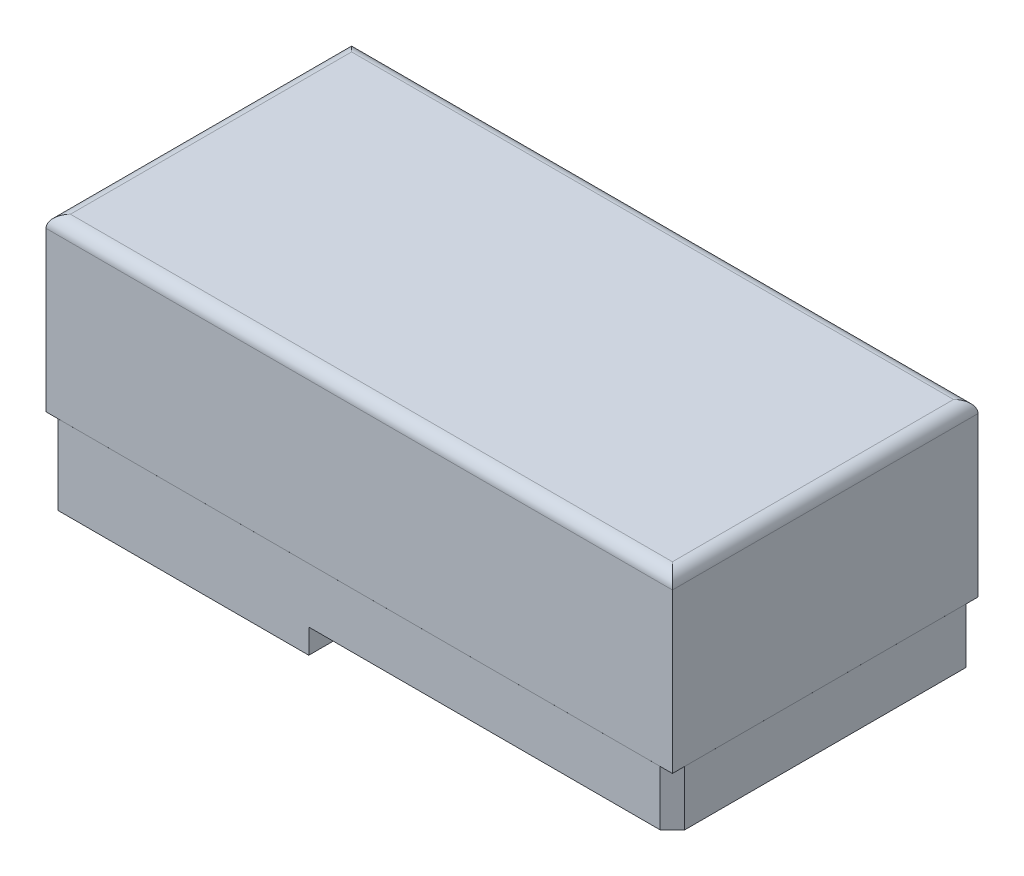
ISO-10303-21;
HEADER;
FILE_DESCRIPTION(('STEP AP214'),'2;1');
FILE_NAME('part.step','',(''),(''),'','','');
FILE_SCHEMA(('AUTOMOTIVE_DESIGN { 1 0 10303 214 1 1 1 1 }'));
ENDSEC;
DATA;
#1=APPLICATION_CONTEXT('core data for automotive mechanical design processes');
#2=APPLICATION_PROTOCOL_DEFINITION('international standard','automotive_design',2000,#1);
#3=PRODUCT_CONTEXT('',#1,'mechanical');
#4=PRODUCT('Part','Part','',(#3));
#5=PRODUCT_RELATED_PRODUCT_CATEGORY('part','',(#4));
#6=PRODUCT_DEFINITION_FORMATION('','',#4);
#7=PRODUCT_DEFINITION_CONTEXT('part definition',#1,'design');
#8=PRODUCT_DEFINITION('design','',#6,#7);
#9=PRODUCT_DEFINITION_SHAPE('','',#8);
#10=(LENGTH_UNIT() NAMED_UNIT(*) SI_UNIT(.MILLI.,.METRE.));
#11=(NAMED_UNIT(*) PLANE_ANGLE_UNIT() SI_UNIT($,.RADIAN.));
#12=(NAMED_UNIT(*) SI_UNIT($,.STERADIAN.) SOLID_ANGLE_UNIT());
#13=UNCERTAINTY_MEASURE_WITH_UNIT(LENGTH_MEASURE(1.E-05),#10,'distance_accuracy_value','');
#14=(GEOMETRIC_REPRESENTATION_CONTEXT(3) GLOBAL_UNCERTAINTY_ASSIGNED_CONTEXT((#13)) GLOBAL_UNIT_ASSIGNED_CONTEXT((#10,
#11,#12)) REPRESENTATION_CONTEXT('',''));
#15=CARTESIAN_POINT('',(0.,0.,0.));
#16=DIRECTION('',(0.,0.,1.));
#17=DIRECTION('',(1.,0.,0.));
#18=AXIS2_PLACEMENT_3D('',#15,#16,#17);
#19=CARTESIAN_POINT('',(-46.0331698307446,-4.,25.));
#20=DIRECTION('',(0.,1.,0.));
#21=DIRECTION('',(-1.,0.,0.));
#22=AXIS2_PLACEMENT_3D('',#19,#20,#21);
#23=PLANE('',#22);
#24=CARTESIAN_POINT('',(-68.0331698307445,-4.00000000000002,0.));
#25=DIRECTION('',(0.,1.,0.));
#26=DIRECTION('',(0.,0.,1.));
#27=AXIS2_PLACEMENT_3D('',#24,#25,#26);
#28=CIRCLE('',#27,7.99999999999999);
#29=CARTESIAN_POINT('',(-68.0331698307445,-4.00000000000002,7.99999999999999));
#30=VERTEX_POINT('',#29);
#31=EDGE_CURVE('E255',#30,#30,#28,.T.);
#32=ORIENTED_EDGE('',*,*,#31,.T.);
#33=EDGE_LOOP('',(#32));
#34=FACE_BOUND('',#33,.T.);
#35=DIRECTION('',(0.,0.,-1.));
#36=VECTOR('',#35,1.);
#37=CARTESIAN_POINT('',(-89.0331698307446,-4.00000000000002,25.));
#38=LINE('',#37,#36);
#39=CARTESIAN_POINT('',(-89.0331698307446,-4.00000000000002,23.));
#40=VERTEX_POINT('',#39);
#41=CARTESIAN_POINT('',(-89.0331698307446,-4.00000000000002,-23.));
#42=VERTEX_POINT('',#41);
#43=EDGE_CURVE('E261',#40,#42,#38,.T.);
#44=ORIENTED_EDGE('',*,*,#43,.T.);
#45=DIRECTION('',(0.70710678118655,0.,-0.707106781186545));
#46=VECTOR('',#45,1.);
#47=CARTESIAN_POINT('',(-89.0331698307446,-4.00000000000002,-23.));
#48=LINE('',#47,#46);
#49=CARTESIAN_POINT('',(-87.0331698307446,-4.00000000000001,-25.));
#50=VERTEX_POINT('',#49);
#51=EDGE_CURVE('E215',#42,#50,#48,.T.);
#52=ORIENTED_EDGE('',*,*,#51,.T.);
#53=DIRECTION('',(1.,0.,0.));
#54=VECTOR('',#53,1.);
#55=CARTESIAN_POINT('',(-46.0331698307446,-4.,-25.));
#56=LINE('',#55,#54);
#57=CARTESIAN_POINT('',(-46.0331698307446,-4.,-25.));
#58=VERTEX_POINT('',#57);
#59=EDGE_CURVE('E257',#50,#58,#56,.T.);
#60=ORIENTED_EDGE('',*,*,#59,.T.);
#61=DIRECTION('',(0.,0.,-1.));
#62=VECTOR('',#61,1.);
#63=CARTESIAN_POINT('',(-46.0331698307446,-4.,25.));
#64=LINE('',#63,#62);
#65=CARTESIAN_POINT('',(-46.0331698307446,-4.,25.));
#66=VERTEX_POINT('',#65);
#67=EDGE_CURVE('E249',#66,#58,#64,.T.);
#68=ORIENTED_EDGE('',*,*,#67,.F.);
#69=DIRECTION('',(1.,0.,0.));
#70=VECTOR('',#69,1.);
#71=CARTESIAN_POINT('',(-46.0331698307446,-4.,25.));
#72=LINE('',#71,#70);
#73=CARTESIAN_POINT('',(-87.0331698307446,-4.00000000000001,25.));
#74=VERTEX_POINT('',#73);
#75=EDGE_CURVE('E199',#74,#66,#72,.T.);
#76=ORIENTED_EDGE('',*,*,#75,.F.);
#77=DIRECTION('',(0.707106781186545,0.,0.70710678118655));
#78=VECTOR('',#77,1.);
#79=CARTESIAN_POINT('',(-87.0331698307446,-4.00000000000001,25.));
#80=LINE('',#79,#78);
#81=EDGE_CURVE('E213',#74,#40,#80,.F.);
#82=ORIENTED_EDGE('',*,*,#81,.T.);
#83=EDGE_LOOP('',(#44,#52,#60,#68,#76,#82));
#84=FACE_BOUND('',#83,.T.);
#85=ADVANCED_FACE('F44',(#34,#84),#23,.F.);
#86=CARTESIAN_POINT('',(-46.0331698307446,0.,25.));
#87=DIRECTION('',(-1.,0.,0.));
#88=DIRECTION('',(0.,0.,1.));
#89=AXIS2_PLACEMENT_3D('',#86,#87,#88);
#90=PLANE('',#89);
#91=DIRECTION('',(0.,1.,0.));
#92=VECTOR('',#91,1.);
#93=CARTESIAN_POINT('',(-46.0331698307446,0.,-25.));
#94=LINE('',#93,#92);
#95=CARTESIAN_POINT('',(-46.0331698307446,0.,-25.));
#96=VERTEX_POINT('',#95);
#97=EDGE_CURVE('E258',#58,#96,#94,.T.);
#98=ORIENTED_EDGE('',*,*,#97,.T.);
#99=DIRECTION('',(0.,0.,-1.));
#100=VECTOR('',#99,1.);
#101=CARTESIAN_POINT('',(-46.0331698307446,0.,25.));
#102=LINE('',#101,#100);
#103=CARTESIAN_POINT('',(-46.0331698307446,0.,25.));
#104=VERTEX_POINT('',#103);
#105=EDGE_CURVE('E205',#104,#96,#102,.T.);
#106=ORIENTED_EDGE('',*,*,#105,.F.);
#107=DIRECTION('',(0.,1.,0.));
#108=VECTOR('',#107,1.);
#109=CARTESIAN_POINT('',(-46.0331698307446,0.,25.));
#110=LINE('',#109,#108);
#111=EDGE_CURVE('E250',#66,#104,#110,.T.);
#112=ORIENTED_EDGE('',*,*,#111,.F.);
#113=ORIENTED_EDGE('',*,*,#67,.T.);
#114=EDGE_LOOP('',(#98,#106,#112,#113));
#115=FACE_BOUND('',#114,.T.);
#116=ADVANCED_FACE('F305',(#115),#90,.F.);
#117=CARTESIAN_POINT('',(13.4668301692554,0.,25.));
#118=DIRECTION('',(0.,1.,0.));
#119=DIRECTION('',(-1.,0.,0.));
#120=AXIS2_PLACEMENT_3D('',#117,#118,#119);
#121=PLANE('',#120);
#122=DIRECTION('',(-1.,0.,0.));
#123=VECTOR('',#122,1.);
#124=CARTESIAN_POINT('',(13.4668301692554,0.,-5.));
#125=LINE('',#124,#123);
#126=CARTESIAN_POINT('',(-4.53316983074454,0.,-5.));
#127=VERTEX_POINT('',#126);
#128=CARTESIAN_POINT('',(-14.5331698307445,0.,-5.));
#129=VERTEX_POINT('',#128);
#130=EDGE_CURVE('E174',#127,#129,#125,.T.);
#131=ORIENTED_EDGE('',*,*,#130,.T.);
#132=CARTESIAN_POINT('',(-14.5331698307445,0.,0.));
#133=DIRECTION('',(0.,1.,0.));
#134=DIRECTION('',(-1.,0.,0.));
#135=AXIS2_PLACEMENT_3D('',#132,#133,#134);
#136=CIRCLE('',#135,5.);
#137=CARTESIAN_POINT('',(-14.5331698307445,0.,5.));
#138=VERTEX_POINT('',#137);
#139=EDGE_CURVE('E172',#129,#138,#136,.T.);
#140=ORIENTED_EDGE('',*,*,#139,.T.);
#141=DIRECTION('',(1.,0.,0.));
#142=VECTOR('',#141,1.);
#143=CARTESIAN_POINT('',(13.4668301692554,0.,5.));
#144=LINE('',#143,#142);
#145=CARTESIAN_POINT('',(-4.53316983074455,0.,5.));
#146=VERTEX_POINT('',#145);
#147=EDGE_CURVE('E152',#138,#146,#144,.T.);
#148=ORIENTED_EDGE('',*,*,#147,.T.);
#149=CARTESIAN_POINT('',(-4.53316983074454,0.,0.));
#150=DIRECTION('',(0.,1.,0.));
#151=DIRECTION('',(-1.,0.,0.));
#152=AXIS2_PLACEMENT_3D('',#149,#150,#151);
#153=CIRCLE('',#152,5.);
#154=EDGE_CURVE('E162',#146,#127,#153,.T.);
#155=ORIENTED_EDGE('',*,*,#154,.T.);
#156=EDGE_LOOP('',(#131,#140,#148,#155));
#157=FACE_BOUND('',#156,.T.);
#158=DIRECTION('',(1.,0.,0.));
#159=VECTOR('',#158,1.);
#160=CARTESIAN_POINT('',(13.4668301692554,0.,-25.));
#161=LINE('',#160,#159);
#162=CARTESIAN_POINT('',(11.4668301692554,0.,-25.));
#163=VERTEX_POINT('',#162);
#164=EDGE_CURVE('E168',#96,#163,#161,.T.);
#165=ORIENTED_EDGE('',*,*,#164,.T.);
#166=DIRECTION('',(0.70710678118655,0.,0.707106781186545));
#167=VECTOR('',#166,1.);
#168=CARTESIAN_POINT('',(13.4668301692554,0.,-23.));
#169=LINE('',#168,#167);
#170=CARTESIAN_POINT('',(13.4668301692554,0.,-23.));
#171=VERTEX_POINT('',#170);
#172=EDGE_CURVE('E65',#163,#171,#169,.T.);
#173=ORIENTED_EDGE('',*,*,#172,.T.);
#174=DIRECTION('',(0.,0.,-1.));
#175=VECTOR('',#174,1.);
#176=CARTESIAN_POINT('',(13.4668301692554,0.,25.));
#177=LINE('',#176,#175);
#178=CARTESIAN_POINT('',(13.4668301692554,0.,23.));
#179=VERTEX_POINT('',#178);
#180=EDGE_CURVE('E204',#179,#171,#177,.T.);
#181=ORIENTED_EDGE('',*,*,#180,.F.);
#182=DIRECTION('',(0.707106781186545,0.,-0.70710678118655));
#183=VECTOR('',#182,1.);
#184=CARTESIAN_POINT('',(11.4668301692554,0.,25.));
#185=LINE('',#184,#183);
#186=CARTESIAN_POINT('',(11.4668301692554,0.,25.));
#187=VERTEX_POINT('',#186);
#188=EDGE_CURVE('E59',#179,#187,#185,.F.);
#189=ORIENTED_EDGE('',*,*,#188,.T.);
#190=DIRECTION('',(1.,0.,0.));
#191=VECTOR('',#190,1.);
#192=CARTESIAN_POINT('',(13.4668301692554,0.,25.));
#193=LINE('',#192,#191);
#194=EDGE_CURVE('E185',#104,#187,#193,.T.);
#195=ORIENTED_EDGE('',*,*,#194,.F.);
#196=ORIENTED_EDGE('',*,*,#105,.T.);
#197=EDGE_LOOP('',(#165,#173,#181,#189,#195,#196));
#198=FACE_BOUND('',#197,.T.);
#199=ADVANCED_FACE('F171',(#157,#198),#121,.F.);
#200=CARTESIAN_POINT('',(13.4668301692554,8.00000000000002,25.));
#201=DIRECTION('',(-1.,0.,0.));
#202=DIRECTION('',(0.,-1.,0.));
#203=AXIS2_PLACEMENT_3D('',#200,#201,#202);
#204=PLANE('',#203);
#205=ORIENTED_EDGE('',*,*,#180,.T.);
#206=DIRECTION('',(0.,1.,0.));
#207=VECTOR('',#206,1.);
#208=CARTESIAN_POINT('',(13.4668301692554,9.,-23.));
#209=LINE('',#208,#207);
#210=CARTESIAN_POINT('',(13.4668301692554,8.99999999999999,-23.));
#211=VERTEX_POINT('',#210);
#212=EDGE_CURVE('E231',#171,#211,#209,.T.);
#213=ORIENTED_EDGE('',*,*,#212,.T.);
#214=DIRECTION('',(0.,0.,1.));
#215=VECTOR('',#214,1.);
#216=CARTESIAN_POINT('',(13.4668301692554,8.99999999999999,25.));
#217=LINE('',#216,#215);
#218=CARTESIAN_POINT('',(13.4668301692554,8.99999999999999,23.));
#219=VERTEX_POINT('',#218);
#220=EDGE_CURVE('E201',#211,#219,#217,.T.);
#221=ORIENTED_EDGE('',*,*,#220,.T.);
#222=DIRECTION('',(0.,-1.,0.));
#223=VECTOR('',#222,1.);
#224=CARTESIAN_POINT('',(13.4668301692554,8.00000000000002,23.));
#225=LINE('',#224,#223);
#226=EDGE_CURVE('E229',#219,#179,#225,.T.);
#227=ORIENTED_EDGE('',*,*,#226,.T.);
#228=EDGE_LOOP('',(#205,#213,#221,#227));
#229=FACE_BOUND('',#228,.T.);
#230=ADVANCED_FACE('F280',(#229),#204,.F.);
#231=CARTESIAN_POINT('',(-89.0331698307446,-4.00000000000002,25.));
#232=DIRECTION('',(1.,0.,0.));
#233=DIRECTION('',(0.,0.,-1.));
#234=AXIS2_PLACEMENT_3D('',#231,#232,#233);
#235=PLANE('',#234);
#236=DIRECTION('',(0.,0.,-1.));
#237=VECTOR('',#236,1.);
#238=CARTESIAN_POINT('',(-89.0331698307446,9.,25.));
#239=LINE('',#238,#237);
#240=CARTESIAN_POINT('',(-89.0331698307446,9.,23.));
#241=VERTEX_POINT('',#240);
#242=CARTESIAN_POINT('',(-89.0331698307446,9.,-23.));
#243=VERTEX_POINT('',#242);
#244=EDGE_CURVE('E200',#241,#243,#239,.T.);
#245=ORIENTED_EDGE('',*,*,#244,.T.);
#246=DIRECTION('',(0.,-1.,0.));
#247=VECTOR('',#246,1.);
#248=CARTESIAN_POINT('',(-89.0331698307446,-4.00000000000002,-23.));
#249=LINE('',#248,#247);
#250=EDGE_CURVE('E210',#243,#42,#249,.T.);
#251=ORIENTED_EDGE('',*,*,#250,.T.);
#252=ORIENTED_EDGE('',*,*,#43,.F.);
#253=DIRECTION('',(0.,1.,0.));
#254=VECTOR('',#253,1.);
#255=CARTESIAN_POINT('',(-89.0331698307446,-4.00000000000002,23.));
#256=LINE('',#255,#254);
#257=EDGE_CURVE('E208',#40,#241,#256,.T.);
#258=ORIENTED_EDGE('',*,*,#257,.T.);
#259=EDGE_LOOP('',(#245,#251,#252,#258));
#260=FACE_BOUND('',#259,.T.);
#261=ADVANCED_FACE('F298',(#260),#235,.F.);
#262=CARTESIAN_POINT('',(0.,0.,25.));
#263=DIRECTION('',(0.,0.,-1.));
#264=DIRECTION('',(-1.,0.,0.));
#265=AXIS2_PLACEMENT_3D('',#262,#263,#264);
#266=PLANE('',#265);
#267=ORIENTED_EDGE('',*,*,#194,.T.);
#268=DIRECTION('',(0.,1.,0.));
#269=VECTOR('',#268,1.);
#270=CARTESIAN_POINT('',(11.4668301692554,0.,25.));
#271=LINE('',#270,#269);
#272=CARTESIAN_POINT('',(11.4668301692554,8.99999999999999,25.));
#273=VERTEX_POINT('',#272);
#274=EDGE_CURVE('E12',#187,#273,#271,.T.);
#275=ORIENTED_EDGE('',*,*,#274,.T.);
#276=DIRECTION('',(-1.,0.,0.));
#277=VECTOR('',#276,1.);
#278=CARTESIAN_POINT('',(0.,8.99999999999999,25.));
#279=LINE('',#278,#277);
#280=CARTESIAN_POINT('',(-87.0331698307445,9.,25.));
#281=VERTEX_POINT('',#280);
#282=EDGE_CURVE('E196',#273,#281,#279,.T.);
#283=ORIENTED_EDGE('',*,*,#282,.T.);
#284=DIRECTION('',(0.,-1.,0.));
#285=VECTOR('',#284,1.);
#286=CARTESIAN_POINT('',(-87.0331698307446,0.,25.));
#287=LINE('',#286,#285);
#288=EDGE_CURVE('E52',#281,#74,#287,.T.);
#289=ORIENTED_EDGE('',*,*,#288,.T.);
#290=ORIENTED_EDGE('',*,*,#75,.T.);
#291=ORIENTED_EDGE('',*,*,#111,.T.);
#292=EDGE_LOOP('',(#267,#275,#283,#289,#290,#291));
#293=FACE_BOUND('',#292,.T.);
#294=ADVANCED_FACE('F239',(#293),#266,.F.);
#295=CARTESIAN_POINT('',(0.,0.,-25.));
#296=DIRECTION('',(0.,0.,-1.));
#297=DIRECTION('',(-1.,0.,0.));
#298=AXIS2_PLACEMENT_3D('',#295,#296,#297);
#299=PLANE('',#298);
#300=ORIENTED_EDGE('',*,*,#59,.F.);
#301=DIRECTION('',(0.,1.,0.));
#302=VECTOR('',#301,1.);
#303=CARTESIAN_POINT('',(-87.0331698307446,9.,-25.));
#304=LINE('',#303,#302);
#305=CARTESIAN_POINT('',(-87.0331698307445,9.,-25.));
#306=VERTEX_POINT('',#305);
#307=EDGE_CURVE('E219',#50,#306,#304,.T.);
#308=ORIENTED_EDGE('',*,*,#307,.T.);
#309=DIRECTION('',(-1.,0.,0.));
#310=VECTOR('',#309,1.);
#311=CARTESIAN_POINT('',(0.,8.99999999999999,-25.));
#312=LINE('',#311,#310);
#313=CARTESIAN_POINT('',(11.4668301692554,8.99999999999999,-25.));
#314=VERTEX_POINT('',#313);
#315=EDGE_CURVE('E195',#314,#306,#312,.T.);
#316=ORIENTED_EDGE('',*,*,#315,.F.);
#317=DIRECTION('',(0.,-1.,0.));
#318=VECTOR('',#317,1.);
#319=CARTESIAN_POINT('',(11.4668301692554,0.,-25.));
#320=LINE('',#319,#318);
#321=EDGE_CURVE('E217',#314,#163,#320,.T.);
#322=ORIENTED_EDGE('',*,*,#321,.T.);
#323=ORIENTED_EDGE('',*,*,#164,.F.);
#324=ORIENTED_EDGE('',*,*,#97,.F.);
#325=EDGE_LOOP('',(#300,#308,#316,#322,#323,#324));
#326=FACE_BOUND('',#325,.T.);
#327=ADVANCED_FACE('F289',(#326),#299,.T.);
#328=CARTESIAN_POINT('',(-68.0331698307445,-4.00000000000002,0.));
#329=DIRECTION('',(0.,1.,0.));
#330=DIRECTION('',(0.,0.,1.));
#331=AXIS2_PLACEMENT_3D('',#328,#329,#330);
#332=CYLINDRICAL_SURFACE('',#331,7.99999999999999);
#333=ORIENTED_EDGE('',*,*,#31,.F.);
#334=EDGE_LOOP('',(#333));
#335=FACE_BOUND('',#334,.T.);
#336=CARTESIAN_POINT('',(-68.0331698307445,8.,0.));
#337=DIRECTION('',(0.,1.,0.));
#338=DIRECTION('',(-1.,0.,0.));
#339=AXIS2_PLACEMENT_3D('',#336,#337,#338);
#340=CIRCLE('',#339,7.99999999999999);
#341=CARTESIAN_POINT('',(-76.0331698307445,8.,0.));
#342=VERTEX_POINT('',#341);
#343=EDGE_CURVE('E190',#342,#342,#340,.F.);
#344=ORIENTED_EDGE('',*,*,#343,.F.);
#345=EDGE_LOOP('',(#344));
#346=FACE_BOUND('',#345,.T.);
#347=ADVANCED_FACE('F315',(#335,#346),#332,.F.);
#348=CARTESIAN_POINT('',(-14.5331698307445,-4.00000000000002,0.));
#349=DIRECTION('',(0.,1.,0.));
#350=DIRECTION('',(0.,0.,1.));
#351=AXIS2_PLACEMENT_3D('',#348,#349,#350);
#352=CYLINDRICAL_SURFACE('',#351,5.);
#353=DIRECTION('',(0.,1.,0.));
#354=VECTOR('',#353,1.);
#355=CARTESIAN_POINT('',(-14.5331698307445,-4.00000000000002,-5.));
#356=LINE('',#355,#354);
#357=CARTESIAN_POINT('',(-14.5331698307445,8.00000000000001,-5.));
#358=VERTEX_POINT('',#357);
#359=EDGE_CURVE('E182',#129,#358,#356,.T.);
#360=ORIENTED_EDGE('',*,*,#359,.T.);
#361=CARTESIAN_POINT('',(-14.5331698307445,8.00000000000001,0.));
#362=DIRECTION('',(0.,1.,0.));
#363=DIRECTION('',(0.,0.,1.));
#364=AXIS2_PLACEMENT_3D('',#361,#362,#363);
#365=CIRCLE('',#364,5.);
#366=CARTESIAN_POINT('',(-14.5331698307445,8.00000000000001,5.));
#367=VERTEX_POINT('',#366);
#368=EDGE_CURVE('E181',#358,#367,#365,.T.);
#369=ORIENTED_EDGE('',*,*,#368,.T.);
#370=DIRECTION('',(0.,1.,0.));
#371=VECTOR('',#370,1.);
#372=CARTESIAN_POINT('',(-14.5331698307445,-4.00000000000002,5.));
#373=LINE('',#372,#371);
#374=EDGE_CURVE('E178',#138,#367,#373,.T.);
#375=ORIENTED_EDGE('',*,*,#374,.F.);
#376=ORIENTED_EDGE('',*,*,#139,.F.);
#377=EDGE_LOOP('',(#360,#369,#375,#376));
#378=FACE_BOUND('',#377,.T.);
#379=ADVANCED_FACE('F318',(#378),#352,.F.);
#380=CARTESIAN_POINT('',(-14.5331698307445,-4.00000000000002,-5.));
#381=DIRECTION('',(0.,0.,-1.));
#382=DIRECTION('',(-1.,0.,0.));
#383=AXIS2_PLACEMENT_3D('',#380,#381,#382);
#384=PLANE('',#383);
#385=DIRECTION('',(0.,1.,0.));
#386=VECTOR('',#385,1.);
#387=CARTESIAN_POINT('',(-4.53316983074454,-4.00000000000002,-5.));
#388=LINE('',#387,#386);
#389=CARTESIAN_POINT('',(-4.53316983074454,8.00000000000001,-5.));
#390=VERTEX_POINT('',#389);
#391=EDGE_CURVE('E165',#127,#390,#388,.T.);
#392=ORIENTED_EDGE('',*,*,#391,.T.);
#393=DIRECTION('',(-1.,0.,0.));
#394=VECTOR('',#393,1.);
#395=CARTESIAN_POINT('',(-14.5331698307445,8.00000000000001,-5.));
#396=LINE('',#395,#394);
#397=EDGE_CURVE('E158',#390,#358,#396,.T.);
#398=ORIENTED_EDGE('',*,*,#397,.T.);
#399=ORIENTED_EDGE('',*,*,#359,.F.);
#400=ORIENTED_EDGE('',*,*,#130,.F.);
#401=EDGE_LOOP('',(#392,#398,#399,#400));
#402=FACE_BOUND('',#401,.T.);
#403=ADVANCED_FACE('F322',(#402),#384,.F.);
#404=CARTESIAN_POINT('',(-4.53316983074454,-4.00000000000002,0.));
#405=DIRECTION('',(0.,1.,0.));
#406=DIRECTION('',(0.,0.,1.));
#407=AXIS2_PLACEMENT_3D('',#404,#405,#406);
#408=CYLINDRICAL_SURFACE('',#407,5.);
#409=DIRECTION('',(0.,1.,0.));
#410=VECTOR('',#409,1.);
#411=CARTESIAN_POINT('',(-4.53316983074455,-4.00000000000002,5.));
#412=LINE('',#411,#410);
#413=CARTESIAN_POINT('',(-4.53316983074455,8.00000000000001,5.));
#414=VERTEX_POINT('',#413);
#415=EDGE_CURVE('E147',#146,#414,#412,.T.);
#416=ORIENTED_EDGE('',*,*,#415,.T.);
#417=CARTESIAN_POINT('',(-4.53316983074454,8.00000000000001,0.));
#418=DIRECTION('',(0.,1.,0.));
#419=DIRECTION('',(0.,0.,1.));
#420=AXIS2_PLACEMENT_3D('',#417,#418,#419);
#421=CIRCLE('',#420,5.);
#422=EDGE_CURVE('E157',#414,#390,#421,.T.);
#423=ORIENTED_EDGE('',*,*,#422,.T.);
#424=ORIENTED_EDGE('',*,*,#391,.F.);
#425=ORIENTED_EDGE('',*,*,#154,.F.);
#426=EDGE_LOOP('',(#416,#423,#424,#425));
#427=FACE_BOUND('',#426,.T.);
#428=ADVANCED_FACE('F163',(#427),#408,.F.);
#429=CARTESIAN_POINT('',(-14.5331698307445,-4.00000000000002,5.));
#430=DIRECTION('',(0.,0.,1.));
#431=DIRECTION('',(1.,0.,0.));
#432=AXIS2_PLACEMENT_3D('',#429,#430,#431);
#433=PLANE('',#432);
#434=ORIENTED_EDGE('',*,*,#374,.T.);
#435=DIRECTION('',(1.,0.,0.));
#436=VECTOR('',#435,1.);
#437=CARTESIAN_POINT('',(-14.5331698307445,8.00000000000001,5.));
#438=LINE('',#437,#436);
#439=EDGE_CURVE('E154',#367,#414,#438,.T.);
#440=ORIENTED_EDGE('',*,*,#439,.T.);
#441=ORIENTED_EDGE('',*,*,#415,.F.);
#442=ORIENTED_EDGE('',*,*,#147,.F.);
#443=EDGE_LOOP('',(#434,#440,#441,#442));
#444=FACE_BOUND('',#443,.T.);
#445=ADVANCED_FACE('F150',(#444),#433,.F.);
#446=CARTESIAN_POINT('',(0.,8.00000000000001,0.));
#447=DIRECTION('',(0.,1.,0.));
#448=DIRECTION('',(-1.,0.,0.));
#449=AXIS2_PLACEMENT_3D('',#446,#447,#448);
#450=PLANE('',#449);
#451=ORIENTED_EDGE('',*,*,#439,.F.);
#452=ORIENTED_EDGE('',*,*,#368,.F.);
#453=ORIENTED_EDGE('',*,*,#397,.F.);
#454=ORIENTED_EDGE('',*,*,#422,.F.);
#455=EDGE_LOOP('',(#451,#452,#453,#454));
#456=FACE_BOUND('',#455,.T.);
#457=ADVANCED_FACE('F326',(#456),#450,.F.);
#458=ORIENTED_EDGE('',*,*,#343,.T.);
#459=EDGE_LOOP('',(#458));
#460=FACE_BOUND('',#459,.T.);
#461=ADVANCED_FACE('F332',(#460),#450,.F.);
#462=CARTESIAN_POINT('',(0.,8.99999999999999,0.));
#463=DIRECTION('',(0.,-1.,0.));
#464=DIRECTION('',(1.,0.,0.));
#465=AXIS2_PLACEMENT_3D('',#462,#463,#464);
#466=PLANE('',#465);
#467=ORIENTED_EDGE('',*,*,#315,.T.);
#468=DIRECTION('',(-0.70710678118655,0.,0.707106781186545));
#469=VECTOR('',#468,1.);
#470=CARTESIAN_POINT('',(-89.0331698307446,9.,-23.));
#471=LINE('',#470,#469);
#472=EDGE_CURVE('E227',#306,#243,#471,.T.);
#473=ORIENTED_EDGE('',*,*,#472,.T.);
#474=ORIENTED_EDGE('',*,*,#244,.F.);
#475=DIRECTION('',(-0.707106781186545,0.,-0.70710678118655));
#476=VECTOR('',#475,1.);
#477=CARTESIAN_POINT('',(-87.0331698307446,9.,25.));
#478=LINE('',#477,#476);
#479=EDGE_CURVE('E221',#241,#281,#478,.F.);
#480=ORIENTED_EDGE('',*,*,#479,.T.);
#481=ORIENTED_EDGE('',*,*,#282,.F.);
#482=DIRECTION('',(-0.707106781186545,0.,0.70710678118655));
#483=VECTOR('',#482,1.);
#484=CARTESIAN_POINT('',(11.4668301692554,8.99999999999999,25.));
#485=LINE('',#484,#483);
#486=EDGE_CURVE('E223',#273,#219,#485,.F.);
#487=ORIENTED_EDGE('',*,*,#486,.T.);
#488=ORIENTED_EDGE('',*,*,#220,.F.);
#489=DIRECTION('',(-0.70710678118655,0.,-0.707106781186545));
#490=VECTOR('',#489,1.);
#491=CARTESIAN_POINT('',(13.4668301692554,8.99999999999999,-23.));
#492=LINE('',#491,#490);
#493=EDGE_CURVE('E225',#211,#314,#492,.T.);
#494=ORIENTED_EDGE('',*,*,#493,.T.);
#495=EDGE_LOOP('',(#467,#473,#474,#480,#481,#487,#488,#494));
#496=FACE_BOUND('',#495,.T.);
#497=ADVANCED_FACE('F278',(#496),#466,.F.);
#498=CARTESIAN_POINT('',(-89.0331698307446,-4.00000000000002,-23.));
#499=DIRECTION('',(-0.707106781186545,0.,-0.70710678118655));
#500=DIRECTION('',(0.,1.,0.));
#501=AXIS2_PLACEMENT_3D('',#498,#499,#500);
#502=PLANE('',#501);
#503=ORIENTED_EDGE('',*,*,#472,.F.);
#504=ORIENTED_EDGE('',*,*,#307,.F.);
#505=ORIENTED_EDGE('',*,*,#51,.F.);
#506=ORIENTED_EDGE('',*,*,#250,.F.);
#507=EDGE_LOOP('',(#503,#504,#505,#506));
#508=FACE_BOUND('',#507,.T.);
#509=ADVANCED_FACE('F294',(#508),#502,.T.);
#510=CARTESIAN_POINT('',(13.4668301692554,8.00000000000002,-23.));
#511=DIRECTION('',(0.707106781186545,0.,-0.70710678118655));
#512=DIRECTION('',(0.,-1.,0.));
#513=AXIS2_PLACEMENT_3D('',#510,#511,#512);
#514=PLANE('',#513);
#515=ORIENTED_EDGE('',*,*,#172,.F.);
#516=ORIENTED_EDGE('',*,*,#321,.F.);
#517=ORIENTED_EDGE('',*,*,#493,.F.);
#518=ORIENTED_EDGE('',*,*,#212,.F.);
#519=EDGE_LOOP('',(#515,#516,#517,#518));
#520=FACE_BOUND('',#519,.T.);
#521=ADVANCED_FACE('F283',(#520),#514,.T.);
#522=CARTESIAN_POINT('',(11.4668301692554,0.,25.));
#523=DIRECTION('',(-0.70710678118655,0.,-0.707106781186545));
#524=DIRECTION('',(0.,1.,0.));
#525=AXIS2_PLACEMENT_3D('',#522,#523,#524);
#526=PLANE('',#525);
#527=ORIENTED_EDGE('',*,*,#188,.F.);
#528=ORIENTED_EDGE('',*,*,#226,.F.);
#529=ORIENTED_EDGE('',*,*,#486,.F.);
#530=ORIENTED_EDGE('',*,*,#274,.F.);
#531=EDGE_LOOP('',(#527,#528,#529,#530));
#532=FACE_BOUND('',#531,.T.);
#533=ADVANCED_FACE('F273',(#532),#526,.F.);
#534=CARTESIAN_POINT('',(-87.0331698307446,0.,25.));
#535=DIRECTION('',(0.70710678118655,0.,-0.707106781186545));
#536=DIRECTION('',(0.,-1.,0.));
#537=AXIS2_PLACEMENT_3D('',#534,#535,#536);
#538=PLANE('',#537);
#539=ORIENTED_EDGE('',*,*,#479,.F.);
#540=ORIENTED_EDGE('',*,*,#257,.F.);
#541=ORIENTED_EDGE('',*,*,#81,.F.);
#542=ORIENTED_EDGE('',*,*,#288,.F.);
#543=EDGE_LOOP('',(#539,#540,#541,#542));
#544=FACE_BOUND('',#543,.T.);
#545=ADVANCED_FACE('F46',(#544),#538,.F.);
#546=CLOSED_SHELL('',(#85,#116,#199,#230,#261,#294,#327,#347,#379,#403,#428,#445,#457,#461,#497,
#509,#521,#533,#545));
#547=MANIFOLD_SOLID_BREP('B2',#546);
#548=CARTESIAN_POINT('',(0.,37.,0.));
#549=DIRECTION('',(0.,1.,0.));
#550=DIRECTION('',(-1.,0.,0.));
#551=AXIS2_PLACEMENT_3D('',#548,#549,#550);
#552=PLANE('',#551);
#553=DIRECTION('',(0.,0.,-1.));
#554=VECTOR('',#553,1.);
#555=CARTESIAN_POINT('',(11.4668301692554,37.,-25.));
#556=LINE('',#555,#554);
#557=CARTESIAN_POINT('',(11.4668301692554,37.,23.));
#558=VERTEX_POINT('',#557);
#559=CARTESIAN_POINT('',(11.4668301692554,37.,-23.));
#560=VERTEX_POINT('',#559);
#561=EDGE_CURVE('E567',#558,#560,#556,.T.);
#562=ORIENTED_EDGE('',*,*,#561,.T.);
#563=DIRECTION('',(-1.,0.,0.));
#564=VECTOR('',#563,1.);
#565=CARTESIAN_POINT('',(0.,37.,-23.));
#566=LINE('',#565,#564);
#567=CARTESIAN_POINT('',(-87.0331698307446,37.,-23.));
#568=VERTEX_POINT('',#567);
#569=EDGE_CURVE('E569',#560,#568,#566,.T.);
#570=ORIENTED_EDGE('',*,*,#569,.T.);
#571=DIRECTION('',(0.,0.,1.));
#572=VECTOR('',#571,1.);
#573=CARTESIAN_POINT('',(-87.0331698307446,37.,25.));
#574=LINE('',#573,#572);
#575=CARTESIAN_POINT('',(-87.0331698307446,37.,23.));
#576=VERTEX_POINT('',#575);
#577=EDGE_CURVE('E545',#568,#576,#574,.T.);
#578=ORIENTED_EDGE('',*,*,#577,.T.);
#579=DIRECTION('',(1.,0.,0.));
#580=VECTOR('',#579,1.);
#581=CARTESIAN_POINT('',(13.4668301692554,37.,23.));
#582=LINE('',#581,#580);
#583=EDGE_CURVE('E565',#576,#558,#582,.T.);
#584=ORIENTED_EDGE('',*,*,#583,.T.);
#585=EDGE_LOOP('',(#562,#570,#578,#584));
#586=FACE_BOUND('',#585,.T.);
#587=ADVANCED_FACE('F479',(#586),#552,.T.);
#588=CARTESIAN_POINT('',(0.,0.,-25.));
#589=DIRECTION('',(0.,0.,-1.));
#590=DIRECTION('',(-1.,0.,0.));
#591=AXIS2_PLACEMENT_3D('',#588,#589,#590);
#592=PLANE('',#591);
#593=DIRECTION('',(0.,-1.,0.));
#594=VECTOR('',#593,1.);
#595=CARTESIAN_POINT('',(-89.0331698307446,-4.00000000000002,-25.));
#596=LINE('',#595,#594);
#597=CARTESIAN_POINT('',(-89.0331698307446,35.,-25.));
#598=VERTEX_POINT('',#597);
#599=CARTESIAN_POINT('',(-89.0331698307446,9.001,-25.));
#600=VERTEX_POINT('',#599);
#601=EDGE_CURVE('E557',#598,#600,#596,.T.);
#602=ORIENTED_EDGE('',*,*,#601,.F.);
#603=DIRECTION('',(-1.,0.,0.));
#604=VECTOR('',#603,1.);
#605=CARTESIAN_POINT('',(0.,35.,-25.));
#606=LINE('',#605,#604);
#607=CARTESIAN_POINT('',(13.4668301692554,35.,-25.));
#608=VERTEX_POINT('',#607);
#609=EDGE_CURVE('E556',#598,#608,#606,.F.);
#610=ORIENTED_EDGE('',*,*,#609,.T.);
#611=DIRECTION('',(0.,1.,0.));
#612=VECTOR('',#611,1.);
#613=CARTESIAN_POINT('',(13.4668301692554,8.00000000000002,-25.));
#614=LINE('',#613,#612);
#615=CARTESIAN_POINT('',(13.4668301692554,9.00099999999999,-25.));
#616=VERTEX_POINT('',#615);
#617=EDGE_CURVE('E549',#616,#608,#614,.T.);
#618=ORIENTED_EDGE('',*,*,#617,.F.);
#619=DIRECTION('',(-1.,0.,0.));
#620=VECTOR('',#619,1.);
#621=CARTESIAN_POINT('',(0.,9.00099999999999,-25.));
#622=LINE('',#621,#620);
#623=EDGE_CURVE('E534',#616,#600,#622,.T.);
#624=ORIENTED_EDGE('',*,*,#623,.T.);
#625=EDGE_LOOP('',(#602,#610,#618,#624));
#626=FACE_BOUND('',#625,.T.);
#627=ADVANCED_FACE('F554',(#626),#592,.T.);
#628=CARTESIAN_POINT('',(0.,0.,25.));
#629=DIRECTION('',(0.,0.,-1.));
#630=DIRECTION('',(-1.,0.,0.));
#631=AXIS2_PLACEMENT_3D('',#628,#629,#630);
#632=PLANE('',#631);
#633=DIRECTION('',(0.,1.,0.));
#634=VECTOR('',#633,1.);
#635=CARTESIAN_POINT('',(13.4668301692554,8.00000000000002,25.));
#636=LINE('',#635,#634);
#637=CARTESIAN_POINT('',(13.4668301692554,9.00099999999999,25.));
#638=VERTEX_POINT('',#637);
#639=CARTESIAN_POINT('',(13.4668301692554,35.,25.));
#640=VERTEX_POINT('',#639);
#641=EDGE_CURVE('E550',#638,#640,#636,.T.);
#642=ORIENTED_EDGE('',*,*,#641,.T.);
#643=DIRECTION('',(1.,0.,0.));
#644=VECTOR('',#643,1.);
#645=CARTESIAN_POINT('',(-89.0331698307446,35.,25.));
#646=LINE('',#645,#644);
#647=CARTESIAN_POINT('',(-89.0331698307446,35.,25.));
#648=VERTEX_POINT('',#647);
#649=EDGE_CURVE('E488',#640,#648,#646,.F.);
#650=ORIENTED_EDGE('',*,*,#649,.T.);
#651=DIRECTION('',(0.,-1.,0.));
#652=VECTOR('',#651,1.);
#653=CARTESIAN_POINT('',(-89.0331698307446,-4.00000000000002,25.));
#654=LINE('',#653,#652);
#655=CARTESIAN_POINT('',(-89.0331698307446,9.001,25.));
#656=VERTEX_POINT('',#655);
#657=EDGE_CURVE('E546',#648,#656,#654,.T.);
#658=ORIENTED_EDGE('',*,*,#657,.T.);
#659=DIRECTION('',(-1.,0.,0.));
#660=VECTOR('',#659,1.);
#661=CARTESIAN_POINT('',(0.,9.00099999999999,25.));
#662=LINE('',#661,#660);
#663=EDGE_CURVE('E551',#638,#656,#662,.T.);
#664=ORIENTED_EDGE('',*,*,#663,.F.);
#665=EDGE_LOOP('',(#642,#650,#658,#664));
#666=FACE_BOUND('',#665,.T.);
#667=ADVANCED_FACE('F589',(#666),#632,.F.);
#668=CARTESIAN_POINT('',(-89.0331698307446,-4.00000000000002,25.));
#669=DIRECTION('',(1.,0.,0.));
#670=DIRECTION('',(0.,0.,-1.));
#671=AXIS2_PLACEMENT_3D('',#668,#669,#670);
#672=PLANE('',#671);
#673=ORIENTED_EDGE('',*,*,#657,.F.);
#674=DIRECTION('',(0.,0.,1.));
#675=VECTOR('',#674,1.);
#676=CARTESIAN_POINT('',(-89.0331698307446,35.,-25.));
#677=LINE('',#676,#675);
#678=EDGE_CURVE('E42',#648,#598,#677,.F.);
#679=ORIENTED_EDGE('',*,*,#678,.T.);
#680=ORIENTED_EDGE('',*,*,#601,.T.);
#681=DIRECTION('',(0.,0.,-1.));
#682=VECTOR('',#681,1.);
#683=CARTESIAN_POINT('',(-89.0331698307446,9.001,25.));
#684=LINE('',#683,#682);
#685=EDGE_CURVE('E541',#656,#600,#684,.T.);
#686=ORIENTED_EDGE('',*,*,#685,.F.);
#687=EDGE_LOOP('',(#673,#679,#680,#686));
#688=FACE_BOUND('',#687,.T.);
#689=ADVANCED_FACE('F591',(#688),#672,.F.);
#690=CARTESIAN_POINT('',(13.4668301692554,8.00000000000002,25.));
#691=DIRECTION('',(-1.,0.,0.));
#692=DIRECTION('',(0.,-1.,0.));
#693=AXIS2_PLACEMENT_3D('',#690,#691,#692);
#694=PLANE('',#693);
#695=ORIENTED_EDGE('',*,*,#617,.T.);
#696=DIRECTION('',(0.,0.,-1.));
#697=VECTOR('',#696,1.);
#698=CARTESIAN_POINT('',(13.4668301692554,35.,25.));
#699=LINE('',#698,#697);
#700=EDGE_CURVE('E503',#608,#640,#699,.F.);
#701=ORIENTED_EDGE('',*,*,#700,.T.);
#702=ORIENTED_EDGE('',*,*,#641,.F.);
#703=DIRECTION('',(0.,0.,1.));
#704=VECTOR('',#703,1.);
#705=CARTESIAN_POINT('',(13.4668301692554,9.00099999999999,25.));
#706=LINE('',#705,#704);
#707=EDGE_CURVE('E538',#616,#638,#706,.T.);
#708=ORIENTED_EDGE('',*,*,#707,.F.);
#709=EDGE_LOOP('',(#695,#701,#702,#708));
#710=FACE_BOUND('',#709,.T.);
#711=ADVANCED_FACE('F548',(#710),#694,.F.);
#712=CARTESIAN_POINT('',(0.,9.00099999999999,0.));
#713=DIRECTION('',(0.,-1.,0.));
#714=DIRECTION('',(1.,0.,0.));
#715=AXIS2_PLACEMENT_3D('',#712,#713,#714);
#716=PLANE('',#715);
#717=ORIENTED_EDGE('',*,*,#663,.T.);
#718=ORIENTED_EDGE('',*,*,#685,.T.);
#719=ORIENTED_EDGE('',*,*,#623,.F.);
#720=ORIENTED_EDGE('',*,*,#707,.T.);
#721=EDGE_LOOP('',(#717,#718,#719,#720));
#722=FACE_BOUND('',#721,.T.);
#723=ADVANCED_FACE('F537',(#722),#716,.T.);
#724=CARTESIAN_POINT('',(0.,35.,23.));
#725=DIRECTION('',(-1.,0.,0.));
#726=DIRECTION('',(0.,-1.,0.));
#727=AXIS2_PLACEMENT_3D('',#724,#725,#726);
#728=CYLINDRICAL_SURFACE('',#727,2.);
#729=CARTESIAN_POINT('',(-87.0331698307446,35.,23.));
#730=DIRECTION('',(-0.707106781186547,0.,-0.707106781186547));
#731=DIRECTION('',(0.707106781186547,0.,-0.707106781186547));
#732=AXIS2_PLACEMENT_3D('',#729,#730,#731);
#733=ELLIPSE('',#732,2.82842712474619,2.);
#734=EDGE_CURVE('E578',#648,#576,#733,.T.);
#735=ORIENTED_EDGE('',*,*,#734,.F.);
#736=ORIENTED_EDGE('',*,*,#649,.F.);
#737=CARTESIAN_POINT('',(11.4668301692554,35.,23.));
#738=DIRECTION('',(-0.707106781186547,0.,0.707106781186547));
#739=DIRECTION('',(-0.707106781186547,0.,-0.707106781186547));
#740=AXIS2_PLACEMENT_3D('',#737,#738,#739);
#741=ELLIPSE('',#740,2.82842712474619,2.);
#742=EDGE_CURVE('E483',#558,#640,#741,.F.);
#743=ORIENTED_EDGE('',*,*,#742,.F.);
#744=ORIENTED_EDGE('',*,*,#583,.F.);
#745=EDGE_LOOP('',(#735,#736,#743,#744));
#746=FACE_BOUND('',#745,.T.);
#747=ADVANCED_FACE('F481',(#746),#728,.T.);
#748=CARTESIAN_POINT('',(11.4668301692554,35.,0.));
#749=DIRECTION('',(0.,0.,1.));
#750=DIRECTION('',(1.,0.,0.));
#751=AXIS2_PLACEMENT_3D('',#748,#749,#750);
#752=CYLINDRICAL_SURFACE('',#751,2.);
#753=ORIENTED_EDGE('',*,*,#742,.T.);
#754=ORIENTED_EDGE('',*,*,#700,.F.);
#755=CARTESIAN_POINT('',(11.4668301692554,35.,-23.));
#756=DIRECTION('',(0.707106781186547,0.,0.707106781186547));
#757=DIRECTION('',(-0.707106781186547,0.,0.707106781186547));
#758=AXIS2_PLACEMENT_3D('',#755,#756,#757);
#759=ELLIPSE('',#758,2.82842712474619,2.);
#760=EDGE_CURVE('E577',#560,#608,#759,.F.);
#761=ORIENTED_EDGE('',*,*,#760,.F.);
#762=ORIENTED_EDGE('',*,*,#561,.F.);
#763=EDGE_LOOP('',(#753,#754,#761,#762));
#764=FACE_BOUND('',#763,.T.);
#765=ADVANCED_FACE('F600',(#764),#752,.T.);
#766=CARTESIAN_POINT('',(-87.0331698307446,35.,0.));
#767=DIRECTION('',(0.,0.,-1.));
#768=DIRECTION('',(-1.,0.,0.));
#769=AXIS2_PLACEMENT_3D('',#766,#767,#768);
#770=CYLINDRICAL_SURFACE('',#769,2.);
#771=ORIENTED_EDGE('',*,*,#734,.T.);
#772=ORIENTED_EDGE('',*,*,#577,.F.);
#773=CARTESIAN_POINT('',(-87.0331698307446,35.,-23.));
#774=DIRECTION('',(0.707106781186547,0.,-0.707106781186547));
#775=DIRECTION('',(-0.707106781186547,0.,-0.707106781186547));
#776=AXIS2_PLACEMENT_3D('',#773,#774,#775);
#777=ELLIPSE('',#776,2.82842712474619,2.);
#778=EDGE_CURVE('E575',#598,#568,#777,.T.);
#779=ORIENTED_EDGE('',*,*,#778,.F.);
#780=ORIENTED_EDGE('',*,*,#678,.F.);
#781=EDGE_LOOP('',(#771,#772,#779,#780));
#782=FACE_BOUND('',#781,.T.);
#783=ADVANCED_FACE('F597',(#782),#770,.T.);
#784=CARTESIAN_POINT('',(0.,35.,-23.));
#785=DIRECTION('',(-1.,0.,0.));
#786=DIRECTION('',(0.,-1.,0.));
#787=AXIS2_PLACEMENT_3D('',#784,#785,#786);
#788=CYLINDRICAL_SURFACE('',#787,2.);
#789=ORIENTED_EDGE('',*,*,#760,.T.);
#790=ORIENTED_EDGE('',*,*,#609,.F.);
#791=ORIENTED_EDGE('',*,*,#778,.T.);
#792=ORIENTED_EDGE('',*,*,#569,.F.);
#793=EDGE_LOOP('',(#789,#790,#791,#792));
#794=FACE_BOUND('',#793,.T.);
#795=ADVANCED_FACE('F594',(#794),#788,.T.);
#796=CLOSED_SHELL('',(#587,#627,#667,#689,#711,#723,#747,#765,#783,#795));
#797=MANIFOLD_SOLID_BREP('B6',#796);
#798=ADVANCED_BREP_SHAPE_REPRESENTATION('',(#18,#547,#797),#14);
#799=SHAPE_DEFINITION_REPRESENTATION(#9,#798);
ENDSEC;
END-ISO-10303-21;
